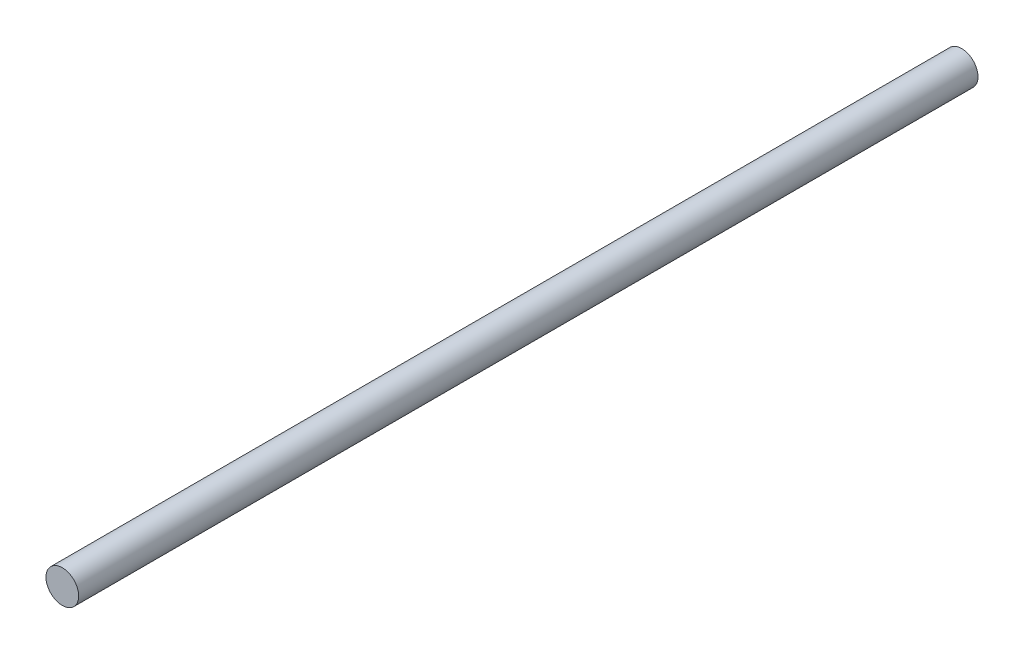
from build123d import *

# Parameters (mm, degrees)
SKETCH1_R           = 30
BOSS_EXTRUDE1_DEPTH = 1650


with BuildPart() as part:
    # Sketch1 → Boss-Extrude1 (new body)
    with BuildSketch(Plane.XY):
        Circle(SKETCH1_R)
    extrude(amount=-BOSS_EXTRUDE1_DEPTH)


solid = part.part
